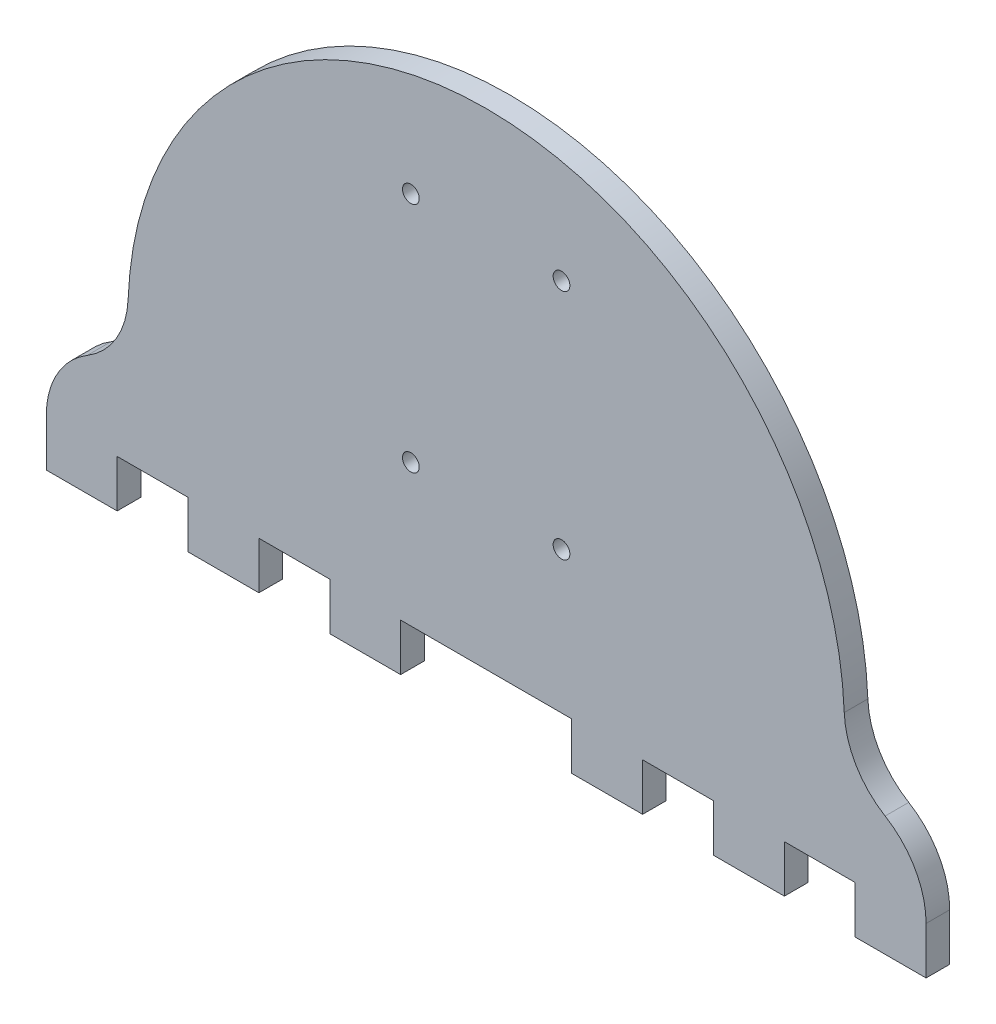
ISO-10303-21;
HEADER;
FILE_DESCRIPTION(('STEP AP214'),'2;1');
FILE_NAME('part.step','',(''),(''),'','','');
FILE_SCHEMA(('AUTOMOTIVE_DESIGN { 1 0 10303 214 1 1 1 1 }'));
ENDSEC;
DATA;
#1=APPLICATION_CONTEXT('core data for automotive mechanical design processes');
#2=APPLICATION_PROTOCOL_DEFINITION('international standard','automotive_design',2000,#1);
#3=PRODUCT_CONTEXT('',#1,'mechanical');
#4=PRODUCT('Part','Part','',(#3));
#5=PRODUCT_RELATED_PRODUCT_CATEGORY('part','',(#4));
#6=PRODUCT_DEFINITION_FORMATION('','',#4);
#7=PRODUCT_DEFINITION_CONTEXT('part definition',#1,'design');
#8=PRODUCT_DEFINITION('design','',#6,#7);
#9=PRODUCT_DEFINITION_SHAPE('','',#8);
#10=(LENGTH_UNIT() NAMED_UNIT(*) SI_UNIT(.MILLI.,.METRE.));
#11=(NAMED_UNIT(*) PLANE_ANGLE_UNIT() SI_UNIT($,.RADIAN.));
#12=(NAMED_UNIT(*) SI_UNIT($,.STERADIAN.) SOLID_ANGLE_UNIT());
#13=UNCERTAINTY_MEASURE_WITH_UNIT(LENGTH_MEASURE(1.E-05),#10,'distance_accuracy_value','');
#14=(GEOMETRIC_REPRESENTATION_CONTEXT(3) GLOBAL_UNCERTAINTY_ASSIGNED_CONTEXT((#13)) GLOBAL_UNIT_ASSIGNED_CONTEXT((#10,
#11,#12)) REPRESENTATION_CONTEXT('',''));
#15=CARTESIAN_POINT('',(0.,0.,0.));
#16=DIRECTION('',(0.,0.,1.));
#17=DIRECTION('',(1.,0.,0.));
#18=AXIS2_PLACEMENT_3D('',#15,#16,#17);
#19=CARTESIAN_POINT('',(0.,-24.8260135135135,6.35));
#20=DIRECTION('',(0.,0.,-1.));
#21=DIRECTION('',(-1.,0.,0.));
#22=AXIS2_PLACEMENT_3D('',#19,#20,#21);
#23=PLANE('',#22);
#24=CARTESIAN_POINT('',(-20.25,41.5,6.35));
#25=DIRECTION('',(0.,0.,1.));
#26=DIRECTION('',(1.,0.,0.));
#27=AXIS2_PLACEMENT_3D('',#24,#25,#26);
#28=CIRCLE('',#27,2.25);
#29=CARTESIAN_POINT('',(-18.,41.5,6.35));
#30=VERTEX_POINT('',#29);
#31=EDGE_CURVE('E795',#30,#30,#28,.T.);
#32=ORIENTED_EDGE('',*,*,#31,.F.);
#33=EDGE_LOOP('',(#32));
#34=FACE_BOUND('',#33,.T.);
#35=CARTESIAN_POINT('',(-20.25,-21.,6.35));
#36=DIRECTION('',(0.,0.,1.));
#37=DIRECTION('',(1.,0.,0.));
#38=AXIS2_PLACEMENT_3D('',#35,#36,#37);
#39=CIRCLE('',#38,2.25);
#40=CARTESIAN_POINT('',(-18.,-21.,6.35));
#41=VERTEX_POINT('',#40);
#42=EDGE_CURVE('E254',#41,#41,#39,.T.);
#43=ORIENTED_EDGE('',*,*,#42,.F.);
#44=EDGE_LOOP('',(#43));
#45=FACE_BOUND('',#44,.T.);
#46=CARTESIAN_POINT('',(0.,-24.8260135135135,6.35));
#47=DIRECTION('',(0.,0.,1.));
#48=DIRECTION('',(-1.,0.,0.));
#49=AXIS2_PLACEMENT_3D('',#46,#47,#48);
#50=CIRCLE('',#49,96.3260135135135);
#51=CARTESIAN_POINT('',(96.25,-21.,6.35));
#52=VERTEX_POINT('',#51);
#53=CARTESIAN_POINT('',(-96.25,-21.,6.35));
#54=VERTEX_POINT('',#53);
#55=EDGE_CURVE('E154',#52,#54,#50,.T.);
#56=ORIENTED_EDGE('',*,*,#55,.T.);
#57=CARTESIAN_POINT('',(-119.01071144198,-20.0952437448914,6.35));
#58=DIRECTION('',(0.,0.,-1.));
#59=DIRECTION('',(-1.,0.,0.));
#60=AXIS2_PLACEMENT_3D('',#57,#58,#59);
#61=CIRCLE('',#60,22.7786867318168);
#62=CARTESIAN_POINT('',(-107.241012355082,-39.5976218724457,6.35));
#63=VERTEX_POINT('',#62);
#64=EDGE_CURVE('E455',#54,#63,#61,.T.);
#65=ORIENTED_EDGE('',*,*,#64,.T.);
#66=CARTESIAN_POINT('',(-95.4713132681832,-59.1,6.35));
#67=DIRECTION('',(0.,0.,1.));
#68=DIRECTION('',(1.,0.,0.));
#69=AXIS2_PLACEMENT_3D('',#66,#67,#68);
#70=CIRCLE('',#69,22.7786867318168);
#71=CARTESIAN_POINT('',(-118.25,-59.1,6.35));
#72=VERTEX_POINT('',#71);
#73=EDGE_CURVE('E382',#63,#72,#70,.T.);
#74=ORIENTED_EDGE('',*,*,#73,.T.);
#75=DIRECTION('',(0.,-1.,0.));
#76=VECTOR('',#75,1.);
#77=CARTESIAN_POINT('',(-118.25,-59.1,6.35));
#78=LINE('',#77,#76);
#79=CARTESIAN_POINT('',(-118.25,-71.8,6.35));
#80=VERTEX_POINT('',#79);
#81=EDGE_CURVE('E401',#72,#80,#78,.T.);
#82=ORIENTED_EDGE('',*,*,#81,.T.);
#83=DIRECTION('',(1.,0.,0.));
#84=VECTOR('',#83,1.);
#85=CARTESIAN_POINT('',(-118.25,-71.8,6.35));
#86=LINE('',#85,#84);
#87=CARTESIAN_POINT('',(-99.2,-71.8,6.35));
#88=VERTEX_POINT('',#87);
#89=EDGE_CURVE('E398',#80,#88,#86,.T.);
#90=ORIENTED_EDGE('',*,*,#89,.T.);
#91=DIRECTION('',(0.,1.,0.));
#92=VECTOR('',#91,1.);
#93=CARTESIAN_POINT('',(-99.2,-71.8,6.35));
#94=LINE('',#93,#92);
#95=CARTESIAN_POINT('',(-99.2,-59.1,6.35));
#96=VERTEX_POINT('',#95);
#97=EDGE_CURVE('E400',#88,#96,#94,.T.);
#98=ORIENTED_EDGE('',*,*,#97,.T.);
#99=DIRECTION('',(1.,0.,0.));
#100=VECTOR('',#99,1.);
#101=CARTESIAN_POINT('',(-99.2,-59.1,6.35));
#102=LINE('',#101,#100);
#103=CARTESIAN_POINT('',(-80.15,-59.1,6.35));
#104=VERTEX_POINT('',#103);
#105=EDGE_CURVE('E403',#96,#104,#102,.T.);
#106=ORIENTED_EDGE('',*,*,#105,.T.);
#107=DIRECTION('',(0.,-1.,0.));
#108=VECTOR('',#107,1.);
#109=CARTESIAN_POINT('',(-80.15,-59.1,6.35));
#110=LINE('',#109,#108);
#111=CARTESIAN_POINT('',(-80.15,-71.8,6.35));
#112=VERTEX_POINT('',#111);
#113=EDGE_CURVE('E409',#104,#112,#110,.T.);
#114=ORIENTED_EDGE('',*,*,#113,.T.);
#115=DIRECTION('',(1.,0.,0.));
#116=VECTOR('',#115,1.);
#117=CARTESIAN_POINT('',(-80.15,-71.8,6.35));
#118=LINE('',#117,#116);
#119=CARTESIAN_POINT('',(-61.1,-71.8,6.35));
#120=VERTEX_POINT('',#119);
#121=EDGE_CURVE('E411',#112,#120,#118,.T.);
#122=ORIENTED_EDGE('',*,*,#121,.T.);
#123=DIRECTION('',(0.,1.,0.));
#124=VECTOR('',#123,1.);
#125=CARTESIAN_POINT('',(-61.1,-71.8,6.35));
#126=LINE('',#125,#124);
#127=CARTESIAN_POINT('',(-61.1,-59.1,6.35));
#128=VERTEX_POINT('',#127);
#129=EDGE_CURVE('E413',#120,#128,#126,.T.);
#130=ORIENTED_EDGE('',*,*,#129,.T.);
#131=DIRECTION('',(1.,0.,0.));
#132=VECTOR('',#131,1.);
#133=CARTESIAN_POINT('',(-61.1,-59.1,6.35));
#134=LINE('',#133,#132);
#135=CARTESIAN_POINT('',(-42.05,-59.1,6.35));
#136=VERTEX_POINT('',#135);
#137=EDGE_CURVE('E415',#128,#136,#134,.T.);
#138=ORIENTED_EDGE('',*,*,#137,.T.);
#139=DIRECTION('',(0.,-1.,0.));
#140=VECTOR('',#139,1.);
#141=CARTESIAN_POINT('',(-42.05,-59.1,6.35));
#142=LINE('',#141,#140);
#143=CARTESIAN_POINT('',(-42.05,-71.8,6.35));
#144=VERTEX_POINT('',#143);
#145=EDGE_CURVE('E417',#136,#144,#142,.T.);
#146=ORIENTED_EDGE('',*,*,#145,.T.);
#147=DIRECTION('',(1.,0.,0.));
#148=VECTOR('',#147,1.);
#149=CARTESIAN_POINT('',(-42.05,-71.8,6.35));
#150=LINE('',#149,#148);
#151=CARTESIAN_POINT('',(-23.,-71.8,6.35));
#152=VERTEX_POINT('',#151);
#153=EDGE_CURVE('E419',#144,#152,#150,.T.);
#154=ORIENTED_EDGE('',*,*,#153,.T.);
#155=DIRECTION('',(0.,1.,0.));
#156=VECTOR('',#155,1.);
#157=CARTESIAN_POINT('',(-23.,-71.8,6.35));
#158=LINE('',#157,#156);
#159=CARTESIAN_POINT('',(-23.,-59.1,6.35));
#160=VERTEX_POINT('',#159);
#161=EDGE_CURVE('E421',#152,#160,#158,.T.);
#162=ORIENTED_EDGE('',*,*,#161,.T.);
#163=DIRECTION('',(1.,0.,0.));
#164=VECTOR('',#163,1.);
#165=CARTESIAN_POINT('',(-23.,-59.1,6.35));
#166=LINE('',#165,#164);
#167=CARTESIAN_POINT('',(22.9999999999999,-59.1,6.35));
#168=VERTEX_POINT('',#167);
#169=EDGE_CURVE('E423',#160,#168,#166,.T.);
#170=ORIENTED_EDGE('',*,*,#169,.T.);
#171=DIRECTION('',(0.,-1.,0.));
#172=VECTOR('',#171,1.);
#173=CARTESIAN_POINT('',(22.9999999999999,-71.8,6.35));
#174=LINE('',#173,#172);
#175=CARTESIAN_POINT('',(22.9999999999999,-71.8,6.35));
#176=VERTEX_POINT('',#175);
#177=EDGE_CURVE('E425',#168,#176,#174,.T.);
#178=ORIENTED_EDGE('',*,*,#177,.T.);
#179=DIRECTION('',(1.,0.,0.));
#180=VECTOR('',#179,1.);
#181=CARTESIAN_POINT('',(42.0499999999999,-71.8,6.35));
#182=LINE('',#181,#180);
#183=CARTESIAN_POINT('',(42.0499999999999,-71.8,6.35));
#184=VERTEX_POINT('',#183);
#185=EDGE_CURVE('E427',#176,#184,#182,.T.);
#186=ORIENTED_EDGE('',*,*,#185,.T.);
#187=DIRECTION('',(0.,1.,0.));
#188=VECTOR('',#187,1.);
#189=CARTESIAN_POINT('',(42.0499999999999,-59.1,6.35));
#190=LINE('',#189,#188);
#191=CARTESIAN_POINT('',(42.0499999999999,-59.1,6.35));
#192=VERTEX_POINT('',#191);
#193=EDGE_CURVE('E429',#184,#192,#190,.T.);
#194=ORIENTED_EDGE('',*,*,#193,.T.);
#195=DIRECTION('',(1.,0.,0.));
#196=VECTOR('',#195,1.);
#197=CARTESIAN_POINT('',(61.0999999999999,-59.1000000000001,6.35));
#198=LINE('',#197,#196);
#199=CARTESIAN_POINT('',(61.0999999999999,-59.1000000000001,6.35));
#200=VERTEX_POINT('',#199);
#201=EDGE_CURVE('E431',#192,#200,#198,.T.);
#202=ORIENTED_EDGE('',*,*,#201,.T.);
#203=DIRECTION('',(0.,-1.,0.));
#204=VECTOR('',#203,1.);
#205=CARTESIAN_POINT('',(61.0999999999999,-71.8000000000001,6.35));
#206=LINE('',#205,#204);
#207=CARTESIAN_POINT('',(61.0999999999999,-71.8000000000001,6.35));
#208=VERTEX_POINT('',#207);
#209=EDGE_CURVE('E433',#200,#208,#206,.T.);
#210=ORIENTED_EDGE('',*,*,#209,.T.);
#211=DIRECTION('',(1.,0.,0.));
#212=VECTOR('',#211,1.);
#213=CARTESIAN_POINT('',(80.15,-71.8,6.35));
#214=LINE('',#213,#212);
#215=CARTESIAN_POINT('',(80.15,-71.8,6.35));
#216=VERTEX_POINT('',#215);
#217=EDGE_CURVE('E435',#208,#216,#214,.T.);
#218=ORIENTED_EDGE('',*,*,#217,.T.);
#219=DIRECTION('',(0.,1.,0.));
#220=VECTOR('',#219,1.);
#221=CARTESIAN_POINT('',(80.15,-59.1,6.35));
#222=LINE('',#221,#220);
#223=CARTESIAN_POINT('',(80.15,-59.1,6.35));
#224=VERTEX_POINT('',#223);
#225=EDGE_CURVE('E437',#216,#224,#222,.T.);
#226=ORIENTED_EDGE('',*,*,#225,.T.);
#227=DIRECTION('',(1.,0.,0.));
#228=VECTOR('',#227,1.);
#229=CARTESIAN_POINT('',(99.2,-59.1,6.35));
#230=LINE('',#229,#228);
#231=CARTESIAN_POINT('',(99.2,-59.1,6.35));
#232=VERTEX_POINT('',#231);
#233=EDGE_CURVE('E439',#224,#232,#230,.T.);
#234=ORIENTED_EDGE('',*,*,#233,.T.);
#235=DIRECTION('',(0.,-1.,0.));
#236=VECTOR('',#235,1.);
#237=CARTESIAN_POINT('',(99.2,-71.8,6.35));
#238=LINE('',#237,#236);
#239=CARTESIAN_POINT('',(99.2,-71.8,6.35));
#240=VERTEX_POINT('',#239);
#241=EDGE_CURVE('E441',#232,#240,#238,.T.);
#242=ORIENTED_EDGE('',*,*,#241,.T.);
#243=DIRECTION('',(1.,0.,0.));
#244=VECTOR('',#243,1.);
#245=CARTESIAN_POINT('',(118.25,-71.8,6.35));
#246=LINE('',#245,#244);
#247=CARTESIAN_POINT('',(118.25,-71.8,6.35));
#248=VERTEX_POINT('',#247);
#249=EDGE_CURVE('E234',#240,#248,#246,.T.);
#250=ORIENTED_EDGE('',*,*,#249,.T.);
#251=DIRECTION('',(0.,1.,0.));
#252=VECTOR('',#251,1.);
#253=CARTESIAN_POINT('',(118.25,-59.1,6.35));
#254=LINE('',#253,#252);
#255=CARTESIAN_POINT('',(118.25,-59.1,6.35));
#256=VERTEX_POINT('',#255);
#257=EDGE_CURVE('E228',#248,#256,#254,.T.);
#258=ORIENTED_EDGE('',*,*,#257,.T.);
#259=CARTESIAN_POINT('',(95.4713132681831,-59.1,6.35));
#260=DIRECTION('',(0.,0.,1.));
#261=DIRECTION('',(-1.,0.,0.));
#262=AXIS2_PLACEMENT_3D('',#259,#260,#261);
#263=CIRCLE('',#262,22.7786867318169);
#264=CARTESIAN_POINT('',(107.241012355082,-39.5976218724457,6.35));
#265=VERTEX_POINT('',#264);
#266=EDGE_CURVE('E232',#256,#265,#263,.T.);
#267=ORIENTED_EDGE('',*,*,#266,.T.);
#268=CARTESIAN_POINT('',(119.01071144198,-20.0952437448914,6.35));
#269=DIRECTION('',(0.,0.,-1.));
#270=DIRECTION('',(1.,0.,0.));
#271=AXIS2_PLACEMENT_3D('',#268,#269,#270);
#272=CIRCLE('',#271,22.7786867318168);
#273=EDGE_CURVE('E52',#265,#52,#272,.T.);
#274=ORIENTED_EDGE('',*,*,#273,.T.);
#275=EDGE_LOOP('',(#56,#65,#74,#82,#90,#98,#106,#114,#122,#130,#138,#146,#154,#162,#170,#178,
#186,#194,#202,#210,#218,#226,#234,#242,#250,#258,#267,#274));
#276=FACE_BOUND('',#275,.T.);
#277=CARTESIAN_POINT('',(20.25,-21.,6.35));
#278=DIRECTION('',(0.,0.,1.));
#279=DIRECTION('',(1.,0.,0.));
#280=AXIS2_PLACEMENT_3D('',#277,#278,#279);
#281=CIRCLE('',#280,2.25);
#282=CARTESIAN_POINT('',(22.5,-21.,6.35));
#283=VERTEX_POINT('',#282);
#284=EDGE_CURVE('E801',#283,#283,#281,.T.);
#285=ORIENTED_EDGE('',*,*,#284,.F.);
#286=EDGE_LOOP('',(#285));
#287=FACE_BOUND('',#286,.T.);
#288=CARTESIAN_POINT('',(20.25,41.5,6.35));
#289=DIRECTION('',(0.,0.,1.));
#290=DIRECTION('',(1.,0.,0.));
#291=AXIS2_PLACEMENT_3D('',#288,#289,#290);
#292=CIRCLE('',#291,2.25);
#293=CARTESIAN_POINT('',(22.5,41.5,6.35));
#294=VERTEX_POINT('',#293);
#295=EDGE_CURVE('E786',#294,#294,#292,.T.);
#296=ORIENTED_EDGE('',*,*,#295,.F.);
#297=EDGE_LOOP('',(#296));
#298=FACE_BOUND('',#297,.T.);
#299=ADVANCED_FACE('F35',(#34,#45,#276,#287,#298),#23,.F.);
#300=CARTESIAN_POINT('',(0.,-24.8260135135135,0.));
#301=DIRECTION('',(0.,0.,-1.));
#302=DIRECTION('',(-1.,0.,0.));
#303=AXIS2_PLACEMENT_3D('',#300,#301,#302);
#304=PLANE('',#303);
#305=CARTESIAN_POINT('',(-20.25,41.5,0.));
#306=DIRECTION('',(0.,0.,1.));
#307=DIRECTION('',(1.,0.,0.));
#308=AXIS2_PLACEMENT_3D('',#305,#306,#307);
#309=CIRCLE('',#308,2.25);
#310=CARTESIAN_POINT('',(-18.,41.5,0.));
#311=VERTEX_POINT('',#310);
#312=EDGE_CURVE('E792',#311,#311,#309,.T.);
#313=ORIENTED_EDGE('',*,*,#312,.T.);
#314=EDGE_LOOP('',(#313));
#315=FACE_BOUND('',#314,.T.);
#316=CARTESIAN_POINT('',(-20.25,-21.,0.));
#317=DIRECTION('',(0.,0.,1.));
#318=DIRECTION('',(1.,0.,0.));
#319=AXIS2_PLACEMENT_3D('',#316,#317,#318);
#320=CIRCLE('',#319,2.25);
#321=CARTESIAN_POINT('',(-18.,-21.,0.));
#322=VERTEX_POINT('',#321);
#323=EDGE_CURVE('E459',#322,#322,#320,.T.);
#324=ORIENTED_EDGE('',*,*,#323,.T.);
#325=EDGE_LOOP('',(#324));
#326=FACE_BOUND('',#325,.T.);
#327=CARTESIAN_POINT('',(0.,-24.8260135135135,0.));
#328=DIRECTION('',(0.,0.,1.));
#329=DIRECTION('',(1.,0.,0.));
#330=AXIS2_PLACEMENT_3D('',#327,#328,#329);
#331=CIRCLE('',#330,96.3260135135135);
#332=CARTESIAN_POINT('',(96.25,-21.,0.));
#333=VERTEX_POINT('',#332);
#334=CARTESIAN_POINT('',(-96.25,-21.,0.));
#335=VERTEX_POINT('',#334);
#336=EDGE_CURVE('E148',#333,#335,#331,.T.);
#337=ORIENTED_EDGE('',*,*,#336,.F.);
#338=CARTESIAN_POINT('',(119.01071144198,-20.0952437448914,0.));
#339=DIRECTION('',(0.,0.,-1.));
#340=DIRECTION('',(1.,0.,0.));
#341=AXIS2_PLACEMENT_3D('',#338,#339,#340);
#342=CIRCLE('',#341,22.7786867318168);
#343=CARTESIAN_POINT('',(107.241012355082,-39.5976218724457,0.));
#344=VERTEX_POINT('',#343);
#345=EDGE_CURVE('E304',#344,#333,#342,.T.);
#346=ORIENTED_EDGE('',*,*,#345,.F.);
#347=CARTESIAN_POINT('',(95.4713132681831,-59.1,0.));
#348=DIRECTION('',(0.,0.,1.));
#349=DIRECTION('',(-1.,0.,0.));
#350=AXIS2_PLACEMENT_3D('',#347,#348,#349);
#351=CIRCLE('',#350,22.7786867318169);
#352=CARTESIAN_POINT('',(118.25,-59.1,0.));
#353=VERTEX_POINT('',#352);
#354=EDGE_CURVE('E141',#353,#344,#351,.T.);
#355=ORIENTED_EDGE('',*,*,#354,.F.);
#356=DIRECTION('',(0.,1.,0.));
#357=VECTOR('',#356,1.);
#358=CARTESIAN_POINT('',(118.25,-59.1,0.));
#359=LINE('',#358,#357);
#360=CARTESIAN_POINT('',(118.25,-71.8,0.));
#361=VERTEX_POINT('',#360);
#362=EDGE_CURVE('E242',#361,#353,#359,.T.);
#363=ORIENTED_EDGE('',*,*,#362,.F.);
#364=DIRECTION('',(1.,0.,0.));
#365=VECTOR('',#364,1.);
#366=CARTESIAN_POINT('',(118.25,-71.8,0.));
#367=LINE('',#366,#365);
#368=CARTESIAN_POINT('',(99.2,-71.8,0.));
#369=VERTEX_POINT('',#368);
#370=EDGE_CURVE('E300',#369,#361,#367,.T.);
#371=ORIENTED_EDGE('',*,*,#370,.F.);
#372=DIRECTION('',(0.,-1.,0.));
#373=VECTOR('',#372,1.);
#374=CARTESIAN_POINT('',(99.2,-71.8,0.));
#375=LINE('',#374,#373);
#376=CARTESIAN_POINT('',(99.2,-59.1,0.));
#377=VERTEX_POINT('',#376);
#378=EDGE_CURVE('E298',#377,#369,#375,.T.);
#379=ORIENTED_EDGE('',*,*,#378,.F.);
#380=DIRECTION('',(1.,0.,0.));
#381=VECTOR('',#380,1.);
#382=CARTESIAN_POINT('',(99.2,-59.1,0.));
#383=LINE('',#382,#381);
#384=CARTESIAN_POINT('',(80.15,-59.1,0.));
#385=VERTEX_POINT('',#384);
#386=EDGE_CURVE('E296',#385,#377,#383,.T.);
#387=ORIENTED_EDGE('',*,*,#386,.F.);
#388=DIRECTION('',(0.,1.,0.));
#389=VECTOR('',#388,1.);
#390=CARTESIAN_POINT('',(80.15,-59.1,0.));
#391=LINE('',#390,#389);
#392=CARTESIAN_POINT('',(80.15,-71.8,0.));
#393=VERTEX_POINT('',#392);
#394=EDGE_CURVE('E294',#393,#385,#391,.T.);
#395=ORIENTED_EDGE('',*,*,#394,.F.);
#396=DIRECTION('',(1.,0.,0.));
#397=VECTOR('',#396,1.);
#398=CARTESIAN_POINT('',(80.15,-71.8,0.));
#399=LINE('',#398,#397);
#400=CARTESIAN_POINT('',(61.0999999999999,-71.8000000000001,0.));
#401=VERTEX_POINT('',#400);
#402=EDGE_CURVE('E292',#401,#393,#399,.T.);
#403=ORIENTED_EDGE('',*,*,#402,.F.);
#404=DIRECTION('',(0.,-1.,0.));
#405=VECTOR('',#404,1.);
#406=CARTESIAN_POINT('',(61.0999999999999,-71.8000000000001,0.));
#407=LINE('',#406,#405);
#408=CARTESIAN_POINT('',(61.0999999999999,-59.1000000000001,0.));
#409=VERTEX_POINT('',#408);
#410=EDGE_CURVE('E290',#409,#401,#407,.T.);
#411=ORIENTED_EDGE('',*,*,#410,.F.);
#412=DIRECTION('',(1.,0.,0.));
#413=VECTOR('',#412,1.);
#414=CARTESIAN_POINT('',(61.0999999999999,-59.1000000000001,0.));
#415=LINE('',#414,#413);
#416=CARTESIAN_POINT('',(42.0499999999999,-59.1,0.));
#417=VERTEX_POINT('',#416);
#418=EDGE_CURVE('E288',#417,#409,#415,.T.);
#419=ORIENTED_EDGE('',*,*,#418,.F.);
#420=DIRECTION('',(0.,1.,0.));
#421=VECTOR('',#420,1.);
#422=CARTESIAN_POINT('',(42.0499999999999,-59.1,0.));
#423=LINE('',#422,#421);
#424=CARTESIAN_POINT('',(42.0499999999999,-71.8,0.));
#425=VERTEX_POINT('',#424);
#426=EDGE_CURVE('E286',#425,#417,#423,.T.);
#427=ORIENTED_EDGE('',*,*,#426,.F.);
#428=DIRECTION('',(1.,0.,0.));
#429=VECTOR('',#428,1.);
#430=CARTESIAN_POINT('',(42.0499999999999,-71.8,0.));
#431=LINE('',#430,#429);
#432=CARTESIAN_POINT('',(22.9999999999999,-71.8,0.));
#433=VERTEX_POINT('',#432);
#434=EDGE_CURVE('E284',#433,#425,#431,.T.);
#435=ORIENTED_EDGE('',*,*,#434,.F.);
#436=DIRECTION('',(0.,-1.,0.));
#437=VECTOR('',#436,1.);
#438=CARTESIAN_POINT('',(22.9999999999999,-71.8,0.));
#439=LINE('',#438,#437);
#440=CARTESIAN_POINT('',(22.9999999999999,-59.1,0.));
#441=VERTEX_POINT('',#440);
#442=EDGE_CURVE('E282',#441,#433,#439,.T.);
#443=ORIENTED_EDGE('',*,*,#442,.F.);
#444=DIRECTION('',(1.,0.,0.));
#445=VECTOR('',#444,1.);
#446=CARTESIAN_POINT('',(-23.,-59.1,0.));
#447=LINE('',#446,#445);
#448=CARTESIAN_POINT('',(-23.,-59.1,0.));
#449=VERTEX_POINT('',#448);
#450=EDGE_CURVE('E280',#449,#441,#447,.T.);
#451=ORIENTED_EDGE('',*,*,#450,.F.);
#452=DIRECTION('',(0.,1.,0.));
#453=VECTOR('',#452,1.);
#454=CARTESIAN_POINT('',(-23.,-71.8,0.));
#455=LINE('',#454,#453);
#456=CARTESIAN_POINT('',(-23.,-71.8,0.));
#457=VERTEX_POINT('',#456);
#458=EDGE_CURVE('E278',#457,#449,#455,.T.);
#459=ORIENTED_EDGE('',*,*,#458,.F.);
#460=DIRECTION('',(1.,0.,0.));
#461=VECTOR('',#460,1.);
#462=CARTESIAN_POINT('',(-42.05,-71.8,0.));
#463=LINE('',#462,#461);
#464=CARTESIAN_POINT('',(-42.05,-71.8,0.));
#465=VERTEX_POINT('',#464);
#466=EDGE_CURVE('E276',#465,#457,#463,.T.);
#467=ORIENTED_EDGE('',*,*,#466,.F.);
#468=DIRECTION('',(0.,-1.,0.));
#469=VECTOR('',#468,1.);
#470=CARTESIAN_POINT('',(-42.05,-59.1,0.));
#471=LINE('',#470,#469);
#472=CARTESIAN_POINT('',(-42.05,-59.1,0.));
#473=VERTEX_POINT('',#472);
#474=EDGE_CURVE('E274',#473,#465,#471,.T.);
#475=ORIENTED_EDGE('',*,*,#474,.F.);
#476=DIRECTION('',(1.,0.,0.));
#477=VECTOR('',#476,1.);
#478=CARTESIAN_POINT('',(-61.1,-59.1,0.));
#479=LINE('',#478,#477);
#480=CARTESIAN_POINT('',(-61.1,-59.1,0.));
#481=VERTEX_POINT('',#480);
#482=EDGE_CURVE('E272',#481,#473,#479,.T.);
#483=ORIENTED_EDGE('',*,*,#482,.F.);
#484=DIRECTION('',(0.,1.,0.));
#485=VECTOR('',#484,1.);
#486=CARTESIAN_POINT('',(-61.1,-71.8,0.));
#487=LINE('',#486,#485);
#488=CARTESIAN_POINT('',(-61.1,-71.8,0.));
#489=VERTEX_POINT('',#488);
#490=EDGE_CURVE('E270',#489,#481,#487,.T.);
#491=ORIENTED_EDGE('',*,*,#490,.F.);
#492=DIRECTION('',(1.,0.,0.));
#493=VECTOR('',#492,1.);
#494=CARTESIAN_POINT('',(-80.15,-71.8,0.));
#495=LINE('',#494,#493);
#496=CARTESIAN_POINT('',(-80.15,-71.8,0.));
#497=VERTEX_POINT('',#496);
#498=EDGE_CURVE('E268',#497,#489,#495,.T.);
#499=ORIENTED_EDGE('',*,*,#498,.F.);
#500=DIRECTION('',(0.,-1.,0.));
#501=VECTOR('',#500,1.);
#502=CARTESIAN_POINT('',(-80.15,-59.1,0.));
#503=LINE('',#502,#501);
#504=CARTESIAN_POINT('',(-80.15,-59.1,0.));
#505=VERTEX_POINT('',#504);
#506=EDGE_CURVE('E266',#505,#497,#503,.T.);
#507=ORIENTED_EDGE('',*,*,#506,.F.);
#508=DIRECTION('',(1.,0.,0.));
#509=VECTOR('',#508,1.);
#510=CARTESIAN_POINT('',(-99.2,-59.1,0.));
#511=LINE('',#510,#509);
#512=CARTESIAN_POINT('',(-99.2,-59.1,0.));
#513=VERTEX_POINT('',#512);
#514=EDGE_CURVE('E264',#513,#505,#511,.T.);
#515=ORIENTED_EDGE('',*,*,#514,.F.);
#516=DIRECTION('',(0.,1.,0.));
#517=VECTOR('',#516,1.);
#518=CARTESIAN_POINT('',(-99.2,-71.8,0.));
#519=LINE('',#518,#517);
#520=CARTESIAN_POINT('',(-99.2,-71.8,0.));
#521=VERTEX_POINT('',#520);
#522=EDGE_CURVE('E262',#521,#513,#519,.T.);
#523=ORIENTED_EDGE('',*,*,#522,.F.);
#524=DIRECTION('',(1.,0.,0.));
#525=VECTOR('',#524,1.);
#526=CARTESIAN_POINT('',(-118.25,-71.8,0.));
#527=LINE('',#526,#525);
#528=CARTESIAN_POINT('',(-118.25,-71.8,0.));
#529=VERTEX_POINT('',#528);
#530=EDGE_CURVE('E260',#529,#521,#527,.T.);
#531=ORIENTED_EDGE('',*,*,#530,.F.);
#532=DIRECTION('',(0.,-1.,0.));
#533=VECTOR('',#532,1.);
#534=CARTESIAN_POINT('',(-118.25,-59.1,0.));
#535=LINE('',#534,#533);
#536=CARTESIAN_POINT('',(-118.25,-59.1,0.));
#537=VERTEX_POINT('',#536);
#538=EDGE_CURVE('E258',#537,#529,#535,.T.);
#539=ORIENTED_EDGE('',*,*,#538,.F.);
#540=CARTESIAN_POINT('',(-95.4713132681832,-59.1,0.));
#541=DIRECTION('',(0.,0.,1.));
#542=DIRECTION('',(1.,0.,0.));
#543=AXIS2_PLACEMENT_3D('',#540,#541,#542);
#544=CIRCLE('',#543,22.7786867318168);
#545=CARTESIAN_POINT('',(-107.241012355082,-39.5976218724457,0.));
#546=VERTEX_POINT('',#545);
#547=EDGE_CURVE('E256',#546,#537,#544,.T.);
#548=ORIENTED_EDGE('',*,*,#547,.F.);
#549=CARTESIAN_POINT('',(-119.01071144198,-20.0952437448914,0.));
#550=DIRECTION('',(0.,0.,-1.));
#551=DIRECTION('',(-1.,0.,0.));
#552=AXIS2_PLACEMENT_3D('',#549,#550,#551);
#553=CIRCLE('',#552,22.7786867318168);
#554=EDGE_CURVE('E253',#335,#546,#553,.T.);
#555=ORIENTED_EDGE('',*,*,#554,.F.);
#556=EDGE_LOOP('',(#337,#346,#355,#363,#371,#379,#387,#395,#403,#411,#419,#427,#435,#443,#451,
#459,#467,#475,#483,#491,#499,#507,#515,#523,#531,#539,#548,#555));
#557=FACE_BOUND('',#556,.T.);
#558=CARTESIAN_POINT('',(20.25,-21.,0.));
#559=DIRECTION('',(0.,0.,1.));
#560=DIRECTION('',(1.,0.,0.));
#561=AXIS2_PLACEMENT_3D('',#558,#559,#560);
#562=CIRCLE('',#561,2.25);
#563=CARTESIAN_POINT('',(22.5,-21.,0.));
#564=VERTEX_POINT('',#563);
#565=EDGE_CURVE('E798',#564,#564,#562,.T.);
#566=ORIENTED_EDGE('',*,*,#565,.T.);
#567=EDGE_LOOP('',(#566));
#568=FACE_BOUND('',#567,.T.);
#569=CARTESIAN_POINT('',(20.25,41.5,0.));
#570=DIRECTION('',(0.,0.,1.));
#571=DIRECTION('',(1.,0.,0.));
#572=AXIS2_PLACEMENT_3D('',#569,#570,#571);
#573=CIRCLE('',#572,2.25);
#574=CARTESIAN_POINT('',(22.5,41.5,0.));
#575=VERTEX_POINT('',#574);
#576=EDGE_CURVE('E789',#575,#575,#573,.T.);
#577=ORIENTED_EDGE('',*,*,#576,.T.);
#578=EDGE_LOOP('',(#577));
#579=FACE_BOUND('',#578,.T.);
#580=ADVANCED_FACE('F386',(#315,#326,#557,#568,#579),#304,.T.);
#581=CARTESIAN_POINT('',(0.,-24.8260135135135,6.35));
#582=DIRECTION('',(0.,0.,-1.));
#583=DIRECTION('',(-1.,0.,0.));
#584=AXIS2_PLACEMENT_3D('',#581,#582,#583);
#585=CYLINDRICAL_SURFACE('',#584,96.3260135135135);
#586=ORIENTED_EDGE('',*,*,#336,.T.);
#587=DIRECTION('',(0.,0.,-1.));
#588=VECTOR('',#587,1.);
#589=CARTESIAN_POINT('',(-96.25,-21.,6.35));
#590=LINE('',#589,#588);
#591=EDGE_CURVE('E11',#54,#335,#590,.T.);
#592=ORIENTED_EDGE('',*,*,#591,.F.);
#593=ORIENTED_EDGE('',*,*,#55,.F.);
#594=DIRECTION('',(0.,0.,-1.));
#595=VECTOR('',#594,1.);
#596=CARTESIAN_POINT('',(96.25,-21.,6.35));
#597=LINE('',#596,#595);
#598=EDGE_CURVE('E248',#52,#333,#597,.T.);
#599=ORIENTED_EDGE('',*,*,#598,.T.);
#600=EDGE_LOOP('',(#586,#592,#593,#599));
#601=FACE_BOUND('',#600,.T.);
#602=ADVANCED_FACE('F37',(#601),#585,.T.);
#603=CARTESIAN_POINT('',(-119.01071144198,-20.0952437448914,6.35));
#604=DIRECTION('',(0.,0.,-1.));
#605=DIRECTION('',(-1.,0.,0.));
#606=AXIS2_PLACEMENT_3D('',#603,#604,#605);
#607=CYLINDRICAL_SURFACE('',#606,22.7786867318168);
#608=ORIENTED_EDGE('',*,*,#554,.T.);
#609=DIRECTION('',(0.,0.,-1.));
#610=VECTOR('',#609,1.);
#611=CARTESIAN_POINT('',(-107.241012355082,-39.5976218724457,6.35));
#612=LINE('',#611,#610);
#613=EDGE_CURVE('E44',#63,#546,#612,.T.);
#614=ORIENTED_EDGE('',*,*,#613,.F.);
#615=ORIENTED_EDGE('',*,*,#64,.F.);
#616=ORIENTED_EDGE('',*,*,#591,.T.);
#617=EDGE_LOOP('',(#608,#614,#615,#616));
#618=FACE_BOUND('',#617,.T.);
#619=ADVANCED_FACE('F461',(#618),#607,.F.);
#620=CARTESIAN_POINT('',(-95.4713132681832,-59.1,6.35));
#621=DIRECTION('',(0.,0.,-1.));
#622=DIRECTION('',(-1.,0.,0.));
#623=AXIS2_PLACEMENT_3D('',#620,#621,#622);
#624=CYLINDRICAL_SURFACE('',#623,22.7786867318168);
#625=ORIENTED_EDGE('',*,*,#547,.T.);
#626=DIRECTION('',(0.,0.,-1.));
#627=VECTOR('',#626,1.);
#628=CARTESIAN_POINT('',(-118.25,-59.1,6.35));
#629=LINE('',#628,#627);
#630=EDGE_CURVE('E373',#72,#537,#629,.T.);
#631=ORIENTED_EDGE('',*,*,#630,.F.);
#632=ORIENTED_EDGE('',*,*,#73,.F.);
#633=ORIENTED_EDGE('',*,*,#613,.T.);
#634=EDGE_LOOP('',(#625,#631,#632,#633));
#635=FACE_BOUND('',#634,.T.);
#636=ADVANCED_FACE('F380',(#635),#624,.T.);
#637=CARTESIAN_POINT('',(-118.25,-59.1,6.35));
#638=DIRECTION('',(1.,0.,0.));
#639=DIRECTION('',(0.,0.,-1.));
#640=AXIS2_PLACEMENT_3D('',#637,#638,#639);
#641=PLANE('',#640);
#642=ORIENTED_EDGE('',*,*,#538,.T.);
#643=DIRECTION('',(0.,0.,-1.));
#644=VECTOR('',#643,1.);
#645=CARTESIAN_POINT('',(-118.25,-71.8,6.35));
#646=LINE('',#645,#644);
#647=EDGE_CURVE('E370',#80,#529,#646,.T.);
#648=ORIENTED_EDGE('',*,*,#647,.F.);
#649=ORIENTED_EDGE('',*,*,#81,.F.);
#650=ORIENTED_EDGE('',*,*,#630,.T.);
#651=EDGE_LOOP('',(#642,#648,#649,#650));
#652=FACE_BOUND('',#651,.T.);
#653=ADVANCED_FACE('F392',(#652),#641,.F.);
#654=CARTESIAN_POINT('',(-118.25,-71.8,6.35));
#655=DIRECTION('',(0.,1.,0.));
#656=DIRECTION('',(0.,0.,1.));
#657=AXIS2_PLACEMENT_3D('',#654,#655,#656);
#658=PLANE('',#657);
#659=ORIENTED_EDGE('',*,*,#530,.T.);
#660=DIRECTION('',(0.,0.,-1.));
#661=VECTOR('',#660,1.);
#662=CARTESIAN_POINT('',(-99.2,-71.8,6.35));
#663=LINE('',#662,#661);
#664=EDGE_CURVE('E367',#88,#521,#663,.T.);
#665=ORIENTED_EDGE('',*,*,#664,.F.);
#666=ORIENTED_EDGE('',*,*,#89,.F.);
#667=ORIENTED_EDGE('',*,*,#647,.T.);
#668=EDGE_LOOP('',(#659,#665,#666,#667));
#669=FACE_BOUND('',#668,.T.);
#670=ADVANCED_FACE('F396',(#669),#658,.F.);
#671=CARTESIAN_POINT('',(-99.2,-71.8,6.35));
#672=DIRECTION('',(-1.,0.,0.));
#673=DIRECTION('',(0.,0.,1.));
#674=AXIS2_PLACEMENT_3D('',#671,#672,#673);
#675=PLANE('',#674);
#676=ORIENTED_EDGE('',*,*,#522,.T.);
#677=DIRECTION('',(0.,0.,-1.));
#678=VECTOR('',#677,1.);
#679=CARTESIAN_POINT('',(-99.2,-59.1,6.35));
#680=LINE('',#679,#678);
#681=EDGE_CURVE('E364',#96,#513,#680,.T.);
#682=ORIENTED_EDGE('',*,*,#681,.F.);
#683=ORIENTED_EDGE('',*,*,#97,.F.);
#684=ORIENTED_EDGE('',*,*,#664,.T.);
#685=EDGE_LOOP('',(#676,#682,#683,#684));
#686=FACE_BOUND('',#685,.T.);
#687=ADVANCED_FACE('F559',(#686),#675,.F.);
#688=CARTESIAN_POINT('',(-99.2,-59.1,6.35));
#689=DIRECTION('',(0.,1.,0.));
#690=DIRECTION('',(-1.,0.,0.));
#691=AXIS2_PLACEMENT_3D('',#688,#689,#690);
#692=PLANE('',#691);
#693=ORIENTED_EDGE('',*,*,#514,.T.);
#694=DIRECTION('',(0.,0.,-1.));
#695=VECTOR('',#694,1.);
#696=CARTESIAN_POINT('',(-80.15,-59.1,6.35));
#697=LINE('',#696,#695);
#698=EDGE_CURVE('E361',#104,#505,#697,.T.);
#699=ORIENTED_EDGE('',*,*,#698,.F.);
#700=ORIENTED_EDGE('',*,*,#105,.F.);
#701=ORIENTED_EDGE('',*,*,#681,.T.);
#702=EDGE_LOOP('',(#693,#699,#700,#701));
#703=FACE_BOUND('',#702,.T.);
#704=ADVANCED_FACE('F555',(#703),#692,.F.);
#705=CARTESIAN_POINT('',(-80.15,-59.1,6.35));
#706=DIRECTION('',(1.,0.,0.));
#707=DIRECTION('',(0.,0.,-1.));
#708=AXIS2_PLACEMENT_3D('',#705,#706,#707);
#709=PLANE('',#708);
#710=ORIENTED_EDGE('',*,*,#506,.T.);
#711=DIRECTION('',(0.,0.,-1.));
#712=VECTOR('',#711,1.);
#713=CARTESIAN_POINT('',(-80.15,-71.8,6.35));
#714=LINE('',#713,#712);
#715=EDGE_CURVE('E358',#112,#497,#714,.T.);
#716=ORIENTED_EDGE('',*,*,#715,.F.);
#717=ORIENTED_EDGE('',*,*,#113,.F.);
#718=ORIENTED_EDGE('',*,*,#698,.T.);
#719=EDGE_LOOP('',(#710,#716,#717,#718));
#720=FACE_BOUND('',#719,.T.);
#721=ADVANCED_FACE('F551',(#720),#709,.F.);
#722=CARTESIAN_POINT('',(-80.15,-71.8,6.35));
#723=DIRECTION('',(0.,1.,0.));
#724=DIRECTION('',(-1.,0.,0.));
#725=AXIS2_PLACEMENT_3D('',#722,#723,#724);
#726=PLANE('',#725);
#727=ORIENTED_EDGE('',*,*,#498,.T.);
#728=DIRECTION('',(0.,0.,-1.));
#729=VECTOR('',#728,1.);
#730=CARTESIAN_POINT('',(-61.1,-71.8,6.35));
#731=LINE('',#730,#729);
#732=EDGE_CURVE('E355',#120,#489,#731,.T.);
#733=ORIENTED_EDGE('',*,*,#732,.F.);
#734=ORIENTED_EDGE('',*,*,#121,.F.);
#735=ORIENTED_EDGE('',*,*,#715,.T.);
#736=EDGE_LOOP('',(#727,#733,#734,#735));
#737=FACE_BOUND('',#736,.T.);
#738=ADVANCED_FACE('F547',(#737),#726,.F.);
#739=CARTESIAN_POINT('',(-61.1,-71.8,6.35));
#740=DIRECTION('',(-1.,0.,0.));
#741=DIRECTION('',(0.,0.,1.));
#742=AXIS2_PLACEMENT_3D('',#739,#740,#741);
#743=PLANE('',#742);
#744=ORIENTED_EDGE('',*,*,#490,.T.);
#745=DIRECTION('',(0.,0.,-1.));
#746=VECTOR('',#745,1.);
#747=CARTESIAN_POINT('',(-61.1,-59.1,6.35));
#748=LINE('',#747,#746);
#749=EDGE_CURVE('E352',#128,#481,#748,.T.);
#750=ORIENTED_EDGE('',*,*,#749,.F.);
#751=ORIENTED_EDGE('',*,*,#129,.F.);
#752=ORIENTED_EDGE('',*,*,#732,.T.);
#753=EDGE_LOOP('',(#744,#750,#751,#752));
#754=FACE_BOUND('',#753,.T.);
#755=ADVANCED_FACE('F543',(#754),#743,.F.);
#756=CARTESIAN_POINT('',(-61.1,-59.1,6.35));
#757=DIRECTION('',(0.,1.,0.));
#758=DIRECTION('',(0.,0.,1.));
#759=AXIS2_PLACEMENT_3D('',#756,#757,#758);
#760=PLANE('',#759);
#761=ORIENTED_EDGE('',*,*,#482,.T.);
#762=DIRECTION('',(0.,0.,-1.));
#763=VECTOR('',#762,1.);
#764=CARTESIAN_POINT('',(-42.05,-59.1,6.35));
#765=LINE('',#764,#763);
#766=EDGE_CURVE('E349',#136,#473,#765,.T.);
#767=ORIENTED_EDGE('',*,*,#766,.F.);
#768=ORIENTED_EDGE('',*,*,#137,.F.);
#769=ORIENTED_EDGE('',*,*,#749,.T.);
#770=EDGE_LOOP('',(#761,#767,#768,#769));
#771=FACE_BOUND('',#770,.T.);
#772=ADVANCED_FACE('F539',(#771),#760,.F.);
#773=CARTESIAN_POINT('',(-42.05,-59.1,6.35));
#774=DIRECTION('',(1.,0.,0.));
#775=DIRECTION('',(0.,0.,-1.));
#776=AXIS2_PLACEMENT_3D('',#773,#774,#775);
#777=PLANE('',#776);
#778=ORIENTED_EDGE('',*,*,#474,.T.);
#779=DIRECTION('',(0.,0.,-1.));
#780=VECTOR('',#779,1.);
#781=CARTESIAN_POINT('',(-42.05,-71.8,6.35));
#782=LINE('',#781,#780);
#783=EDGE_CURVE('E346',#144,#465,#782,.T.);
#784=ORIENTED_EDGE('',*,*,#783,.F.);
#785=ORIENTED_EDGE('',*,*,#145,.F.);
#786=ORIENTED_EDGE('',*,*,#766,.T.);
#787=EDGE_LOOP('',(#778,#784,#785,#786));
#788=FACE_BOUND('',#787,.T.);
#789=ADVANCED_FACE('F535',(#788),#777,.F.);
#790=CARTESIAN_POINT('',(-42.05,-71.8,6.35));
#791=DIRECTION('',(0.,1.,0.));
#792=DIRECTION('',(0.,0.,1.));
#793=AXIS2_PLACEMENT_3D('',#790,#791,#792);
#794=PLANE('',#793);
#795=ORIENTED_EDGE('',*,*,#466,.T.);
#796=DIRECTION('',(0.,0.,-1.));
#797=VECTOR('',#796,1.);
#798=CARTESIAN_POINT('',(-23.,-71.8,6.35));
#799=LINE('',#798,#797);
#800=EDGE_CURVE('E343',#152,#457,#799,.T.);
#801=ORIENTED_EDGE('',*,*,#800,.F.);
#802=ORIENTED_EDGE('',*,*,#153,.F.);
#803=ORIENTED_EDGE('',*,*,#783,.T.);
#804=EDGE_LOOP('',(#795,#801,#802,#803));
#805=FACE_BOUND('',#804,.T.);
#806=ADVANCED_FACE('F531',(#805),#794,.F.);
#807=CARTESIAN_POINT('',(-23.,-71.8,6.35));
#808=DIRECTION('',(-1.,0.,0.));
#809=DIRECTION('',(0.,0.,1.));
#810=AXIS2_PLACEMENT_3D('',#807,#808,#809);
#811=PLANE('',#810);
#812=ORIENTED_EDGE('',*,*,#458,.T.);
#813=DIRECTION('',(0.,0.,-1.));
#814=VECTOR('',#813,1.);
#815=CARTESIAN_POINT('',(-23.,-59.1,6.35));
#816=LINE('',#815,#814);
#817=EDGE_CURVE('E340',#160,#449,#816,.T.);
#818=ORIENTED_EDGE('',*,*,#817,.F.);
#819=ORIENTED_EDGE('',*,*,#161,.F.);
#820=ORIENTED_EDGE('',*,*,#800,.T.);
#821=EDGE_LOOP('',(#812,#818,#819,#820));
#822=FACE_BOUND('',#821,.T.);
#823=ADVANCED_FACE('F527',(#822),#811,.F.);
#824=CARTESIAN_POINT('',(-23.,-59.1,6.35));
#825=DIRECTION('',(0.,1.,0.));
#826=DIRECTION('',(0.,0.,1.));
#827=AXIS2_PLACEMENT_3D('',#824,#825,#826);
#828=PLANE('',#827);
#829=ORIENTED_EDGE('',*,*,#450,.T.);
#830=DIRECTION('',(0.,0.,-1.));
#831=VECTOR('',#830,1.);
#832=CARTESIAN_POINT('',(22.9999999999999,-59.1,6.35));
#833=LINE('',#832,#831);
#834=EDGE_CURVE('E337',#168,#441,#833,.T.);
#835=ORIENTED_EDGE('',*,*,#834,.F.);
#836=ORIENTED_EDGE('',*,*,#169,.F.);
#837=ORIENTED_EDGE('',*,*,#817,.T.);
#838=EDGE_LOOP('',(#829,#835,#836,#837));
#839=FACE_BOUND('',#838,.T.);
#840=ADVANCED_FACE('F523',(#839),#828,.F.);
#841=CARTESIAN_POINT('',(22.9999999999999,-71.8,6.35));
#842=DIRECTION('',(1.,0.,0.));
#843=DIRECTION('',(0.,1.,0.));
#844=AXIS2_PLACEMENT_3D('',#841,#842,#843);
#845=PLANE('',#844);
#846=ORIENTED_EDGE('',*,*,#442,.T.);
#847=DIRECTION('',(0.,0.,-1.));
#848=VECTOR('',#847,1.);
#849=CARTESIAN_POINT('',(22.9999999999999,-71.8,6.35));
#850=LINE('',#849,#848);
#851=EDGE_CURVE('E334',#176,#433,#850,.T.);
#852=ORIENTED_EDGE('',*,*,#851,.F.);
#853=ORIENTED_EDGE('',*,*,#177,.F.);
#854=ORIENTED_EDGE('',*,*,#834,.T.);
#855=EDGE_LOOP('',(#846,#852,#853,#854));
#856=FACE_BOUND('',#855,.T.);
#857=ADVANCED_FACE('F519',(#856),#845,.F.);
#858=CARTESIAN_POINT('',(42.0499999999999,-71.8,6.35));
#859=DIRECTION('',(0.,1.,0.));
#860=DIRECTION('',(0.,0.,1.));
#861=AXIS2_PLACEMENT_3D('',#858,#859,#860);
#862=PLANE('',#861);
#863=ORIENTED_EDGE('',*,*,#434,.T.);
#864=DIRECTION('',(0.,0.,-1.));
#865=VECTOR('',#864,1.);
#866=CARTESIAN_POINT('',(42.0499999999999,-71.8,6.35));
#867=LINE('',#866,#865);
#868=EDGE_CURVE('E331',#184,#425,#867,.T.);
#869=ORIENTED_EDGE('',*,*,#868,.F.);
#870=ORIENTED_EDGE('',*,*,#185,.F.);
#871=ORIENTED_EDGE('',*,*,#851,.T.);
#872=EDGE_LOOP('',(#863,#869,#870,#871));
#873=FACE_BOUND('',#872,.T.);
#874=ADVANCED_FACE('F515',(#873),#862,.F.);
#875=CARTESIAN_POINT('',(42.0499999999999,-59.1,6.35));
#876=DIRECTION('',(-1.,0.,0.));
#877=DIRECTION('',(0.,0.,1.));
#878=AXIS2_PLACEMENT_3D('',#875,#876,#877);
#879=PLANE('',#878);
#880=ORIENTED_EDGE('',*,*,#426,.T.);
#881=DIRECTION('',(0.,0.,-1.));
#882=VECTOR('',#881,1.);
#883=CARTESIAN_POINT('',(42.0499999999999,-59.1,6.35));
#884=LINE('',#883,#882);
#885=EDGE_CURVE('E328',#192,#417,#884,.T.);
#886=ORIENTED_EDGE('',*,*,#885,.F.);
#887=ORIENTED_EDGE('',*,*,#193,.F.);
#888=ORIENTED_EDGE('',*,*,#868,.T.);
#889=EDGE_LOOP('',(#880,#886,#887,#888));
#890=FACE_BOUND('',#889,.T.);
#891=ADVANCED_FACE('F511',(#890),#879,.F.);
#892=CARTESIAN_POINT('',(61.0999999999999,-59.1000000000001,6.35));
#893=DIRECTION('',(0.,1.,0.));
#894=DIRECTION('',(-1.,0.,0.));
#895=AXIS2_PLACEMENT_3D('',#892,#893,#894);
#896=PLANE('',#895);
#897=ORIENTED_EDGE('',*,*,#418,.T.);
#898=DIRECTION('',(0.,0.,-1.));
#899=VECTOR('',#898,1.);
#900=CARTESIAN_POINT('',(61.0999999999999,-59.1000000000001,6.35));
#901=LINE('',#900,#899);
#902=EDGE_CURVE('E325',#200,#409,#901,.T.);
#903=ORIENTED_EDGE('',*,*,#902,.F.);
#904=ORIENTED_EDGE('',*,*,#201,.F.);
#905=ORIENTED_EDGE('',*,*,#885,.T.);
#906=EDGE_LOOP('',(#897,#903,#904,#905));
#907=FACE_BOUND('',#906,.T.);
#908=ADVANCED_FACE('F507',(#907),#896,.F.);
#909=CARTESIAN_POINT('',(61.0999999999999,-71.8000000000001,6.35));
#910=DIRECTION('',(1.,0.,0.));
#911=DIRECTION('',(0.,0.,-1.));
#912=AXIS2_PLACEMENT_3D('',#909,#910,#911);
#913=PLANE('',#912);
#914=ORIENTED_EDGE('',*,*,#410,.T.);
#915=DIRECTION('',(0.,0.,-1.));
#916=VECTOR('',#915,1.);
#917=CARTESIAN_POINT('',(61.0999999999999,-71.8000000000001,6.35));
#918=LINE('',#917,#916);
#919=EDGE_CURVE('E322',#208,#401,#918,.T.);
#920=ORIENTED_EDGE('',*,*,#919,.F.);
#921=ORIENTED_EDGE('',*,*,#209,.F.);
#922=ORIENTED_EDGE('',*,*,#902,.T.);
#923=EDGE_LOOP('',(#914,#920,#921,#922));
#924=FACE_BOUND('',#923,.T.);
#925=ADVANCED_FACE('F503',(#924),#913,.F.);
#926=CARTESIAN_POINT('',(80.15,-71.8,6.35));
#927=DIRECTION('',(0.,1.,0.));
#928=DIRECTION('',(-1.,0.,0.));
#929=AXIS2_PLACEMENT_3D('',#926,#927,#928);
#930=PLANE('',#929);
#931=ORIENTED_EDGE('',*,*,#402,.T.);
#932=DIRECTION('',(0.,0.,-1.));
#933=VECTOR('',#932,1.);
#934=CARTESIAN_POINT('',(80.15,-71.8,6.35));
#935=LINE('',#934,#933);
#936=EDGE_CURVE('E319',#216,#393,#935,.T.);
#937=ORIENTED_EDGE('',*,*,#936,.F.);
#938=ORIENTED_EDGE('',*,*,#217,.F.);
#939=ORIENTED_EDGE('',*,*,#919,.T.);
#940=EDGE_LOOP('',(#931,#937,#938,#939));
#941=FACE_BOUND('',#940,.T.);
#942=ADVANCED_FACE('F499',(#941),#930,.F.);
#943=CARTESIAN_POINT('',(80.15,-59.1,6.35));
#944=DIRECTION('',(-1.,0.,0.));
#945=DIRECTION('',(0.,0.,1.));
#946=AXIS2_PLACEMENT_3D('',#943,#944,#945);
#947=PLANE('',#946);
#948=ORIENTED_EDGE('',*,*,#394,.T.);
#949=DIRECTION('',(0.,0.,-1.));
#950=VECTOR('',#949,1.);
#951=CARTESIAN_POINT('',(80.15,-59.1,6.35));
#952=LINE('',#951,#950);
#953=EDGE_CURVE('E316',#224,#385,#952,.T.);
#954=ORIENTED_EDGE('',*,*,#953,.F.);
#955=ORIENTED_EDGE('',*,*,#225,.F.);
#956=ORIENTED_EDGE('',*,*,#936,.T.);
#957=EDGE_LOOP('',(#948,#954,#955,#956));
#958=FACE_BOUND('',#957,.T.);
#959=ADVANCED_FACE('F495',(#958),#947,.F.);
#960=CARTESIAN_POINT('',(99.2,-59.1,6.35));
#961=DIRECTION('',(0.,1.,0.));
#962=DIRECTION('',(-1.,0.,0.));
#963=AXIS2_PLACEMENT_3D('',#960,#961,#962);
#964=PLANE('',#963);
#965=ORIENTED_EDGE('',*,*,#386,.T.);
#966=DIRECTION('',(0.,0.,-1.));
#967=VECTOR('',#966,1.);
#968=CARTESIAN_POINT('',(99.2,-59.1,6.35));
#969=LINE('',#968,#967);
#970=EDGE_CURVE('E313',#232,#377,#969,.T.);
#971=ORIENTED_EDGE('',*,*,#970,.F.);
#972=ORIENTED_EDGE('',*,*,#233,.F.);
#973=ORIENTED_EDGE('',*,*,#953,.T.);
#974=EDGE_LOOP('',(#965,#971,#972,#973));
#975=FACE_BOUND('',#974,.T.);
#976=ADVANCED_FACE('F492',(#975),#964,.F.);
#977=CARTESIAN_POINT('',(99.2,-71.8,6.35));
#978=DIRECTION('',(1.,0.,0.));
#979=DIRECTION('',(0.,0.,-1.));
#980=AXIS2_PLACEMENT_3D('',#977,#978,#979);
#981=PLANE('',#980);
#982=ORIENTED_EDGE('',*,*,#378,.T.);
#983=DIRECTION('',(0.,0.,-1.));
#984=VECTOR('',#983,1.);
#985=CARTESIAN_POINT('',(99.2,-71.8,6.35));
#986=LINE('',#985,#984);
#987=EDGE_CURVE('E310',#240,#369,#986,.T.);
#988=ORIENTED_EDGE('',*,*,#987,.F.);
#989=ORIENTED_EDGE('',*,*,#241,.F.);
#990=ORIENTED_EDGE('',*,*,#970,.T.);
#991=EDGE_LOOP('',(#982,#988,#989,#990));
#992=FACE_BOUND('',#991,.T.);
#993=ADVANCED_FACE('F447',(#992),#981,.F.);
#994=CARTESIAN_POINT('',(118.25,-71.8,6.35));
#995=DIRECTION('',(0.,1.,0.));
#996=DIRECTION('',(0.,0.,1.));
#997=AXIS2_PLACEMENT_3D('',#994,#995,#996);
#998=PLANE('',#997);
#999=ORIENTED_EDGE('',*,*,#370,.T.);
#1000=DIRECTION('',(0.,0.,-1.));
#1001=VECTOR('',#1000,1.);
#1002=CARTESIAN_POINT('',(118.25,-71.8,6.35));
#1003=LINE('',#1002,#1001);
#1004=EDGE_CURVE('E243',#248,#361,#1003,.T.);
#1005=ORIENTED_EDGE('',*,*,#1004,.F.);
#1006=ORIENTED_EDGE('',*,*,#249,.F.);
#1007=ORIENTED_EDGE('',*,*,#987,.T.);
#1008=EDGE_LOOP('',(#999,#1005,#1006,#1007));
#1009=FACE_BOUND('',#1008,.T.);
#1010=ADVANCED_FACE('F451',(#1009),#998,.F.);
#1011=CARTESIAN_POINT('',(118.25,-59.1,6.35));
#1012=DIRECTION('',(-1.,0.,0.));
#1013=DIRECTION('',(0.,-1.,0.));
#1014=AXIS2_PLACEMENT_3D('',#1011,#1012,#1013);
#1015=PLANE('',#1014);
#1016=ORIENTED_EDGE('',*,*,#362,.T.);
#1017=DIRECTION('',(0.,0.,-1.));
#1018=VECTOR('',#1017,1.);
#1019=CARTESIAN_POINT('',(118.25,-59.1,6.35));
#1020=LINE('',#1019,#1018);
#1021=EDGE_CURVE('E239',#256,#353,#1020,.T.);
#1022=ORIENTED_EDGE('',*,*,#1021,.F.);
#1023=ORIENTED_EDGE('',*,*,#257,.F.);
#1024=ORIENTED_EDGE('',*,*,#1004,.T.);
#1025=EDGE_LOOP('',(#1016,#1022,#1023,#1024));
#1026=FACE_BOUND('',#1025,.T.);
#1027=ADVANCED_FACE('F240',(#1026),#1015,.F.);
#1028=CARTESIAN_POINT('',(95.4713132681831,-59.1,6.35));
#1029=DIRECTION('',(0.,0.,-1.));
#1030=DIRECTION('',(-1.,0.,0.));
#1031=AXIS2_PLACEMENT_3D('',#1028,#1029,#1030);
#1032=CYLINDRICAL_SURFACE('',#1031,22.7786867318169);
#1033=ORIENTED_EDGE('',*,*,#354,.T.);
#1034=DIRECTION('',(0.,0.,-1.));
#1035=VECTOR('',#1034,1.);
#1036=CARTESIAN_POINT('',(107.241012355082,-39.5976218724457,6.35));
#1037=LINE('',#1036,#1035);
#1038=EDGE_CURVE('E244',#265,#344,#1037,.T.);
#1039=ORIENTED_EDGE('',*,*,#1038,.F.);
#1040=ORIENTED_EDGE('',*,*,#266,.F.);
#1041=ORIENTED_EDGE('',*,*,#1021,.T.);
#1042=EDGE_LOOP('',(#1033,#1039,#1040,#1041));
#1043=FACE_BOUND('',#1042,.T.);
#1044=ADVANCED_FACE('F246',(#1043),#1032,.T.);
#1045=CARTESIAN_POINT('',(119.01071144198,-20.0952437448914,6.35));
#1046=DIRECTION('',(0.,0.,-1.));
#1047=DIRECTION('',(-1.,0.,0.));
#1048=AXIS2_PLACEMENT_3D('',#1045,#1046,#1047);
#1049=CYLINDRICAL_SURFACE('',#1048,22.7786867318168);
#1050=ORIENTED_EDGE('',*,*,#345,.T.);
#1051=ORIENTED_EDGE('',*,*,#598,.F.);
#1052=ORIENTED_EDGE('',*,*,#273,.F.);
#1053=ORIENTED_EDGE('',*,*,#1038,.T.);
#1054=EDGE_LOOP('',(#1050,#1051,#1052,#1053));
#1055=FACE_BOUND('',#1054,.T.);
#1056=ADVANCED_FACE('F453',(#1055),#1049,.F.);
#1057=CARTESIAN_POINT('',(-20.25,-21.,6.35));
#1058=DIRECTION('',(0.,0.,-1.));
#1059=DIRECTION('',(-1.,0.,0.));
#1060=AXIS2_PLACEMENT_3D('',#1057,#1058,#1059);
#1061=CYLINDRICAL_SURFACE('',#1060,2.25);
#1062=ORIENTED_EDGE('',*,*,#42,.T.);
#1063=EDGE_LOOP('',(#1062));
#1064=FACE_BOUND('',#1063,.T.);
#1065=ORIENTED_EDGE('',*,*,#323,.F.);
#1066=EDGE_LOOP('',(#1065));
#1067=FACE_BOUND('',#1066,.T.);
#1068=ADVANCED_FACE('F479',(#1064,#1067),#1061,.F.);
#1069=CARTESIAN_POINT('',(20.25,-21.,6.35));
#1070=DIRECTION('',(0.,0.,-1.));
#1071=DIRECTION('',(-1.,0.,0.));
#1072=AXIS2_PLACEMENT_3D('',#1069,#1070,#1071);
#1073=CYLINDRICAL_SURFACE('',#1072,2.25);
#1074=ORIENTED_EDGE('',*,*,#284,.T.);
#1075=EDGE_LOOP('',(#1074));
#1076=FACE_BOUND('',#1075,.T.);
#1077=ORIENTED_EDGE('',*,*,#565,.F.);
#1078=EDGE_LOOP('',(#1077));
#1079=FACE_BOUND('',#1078,.T.);
#1080=ADVANCED_FACE('F673',(#1076,#1079),#1073,.F.);
#1081=CARTESIAN_POINT('',(-20.25,41.5,6.35));
#1082=DIRECTION('',(0.,0.,-1.));
#1083=DIRECTION('',(-1.,0.,0.));
#1084=AXIS2_PLACEMENT_3D('',#1081,#1082,#1083);
#1085=CYLINDRICAL_SURFACE('',#1084,2.25);
#1086=ORIENTED_EDGE('',*,*,#31,.T.);
#1087=EDGE_LOOP('',(#1086));
#1088=FACE_BOUND('',#1087,.T.);
#1089=ORIENTED_EDGE('',*,*,#312,.F.);
#1090=EDGE_LOOP('',(#1089));
#1091=FACE_BOUND('',#1090,.T.);
#1092=ADVANCED_FACE('F680',(#1088,#1091),#1085,.F.);
#1093=CARTESIAN_POINT('',(20.25,41.5,6.35));
#1094=DIRECTION('',(0.,0.,-1.));
#1095=DIRECTION('',(-1.,0.,0.));
#1096=AXIS2_PLACEMENT_3D('',#1093,#1094,#1095);
#1097=CYLINDRICAL_SURFACE('',#1096,2.25);
#1098=ORIENTED_EDGE('',*,*,#295,.T.);
#1099=EDGE_LOOP('',(#1098));
#1100=FACE_BOUND('',#1099,.T.);
#1101=ORIENTED_EDGE('',*,*,#576,.F.);
#1102=EDGE_LOOP('',(#1101));
#1103=FACE_BOUND('',#1102,.T.);
#1104=ADVANCED_FACE('F687',(#1100,#1103),#1097,.F.);
#1105=CLOSED_SHELL('',(#299,#580,#602,#619,#636,#653,#670,#687,#704,#721,#738,#755,#772,#789,
#806,#823,#840,#857,#874,#891,#908,#925,#942,#959,#976,#993,#1010,#1027,#1044,#1056,#1068,#1080,
#1092,#1104));
#1106=MANIFOLD_SOLID_BREP('B2',#1105);
#1107=ADVANCED_BREP_SHAPE_REPRESENTATION('',(#18,#1106),#14);
#1108=SHAPE_DEFINITION_REPRESENTATION(#9,#1107);
ENDSEC;
END-ISO-10303-21;
